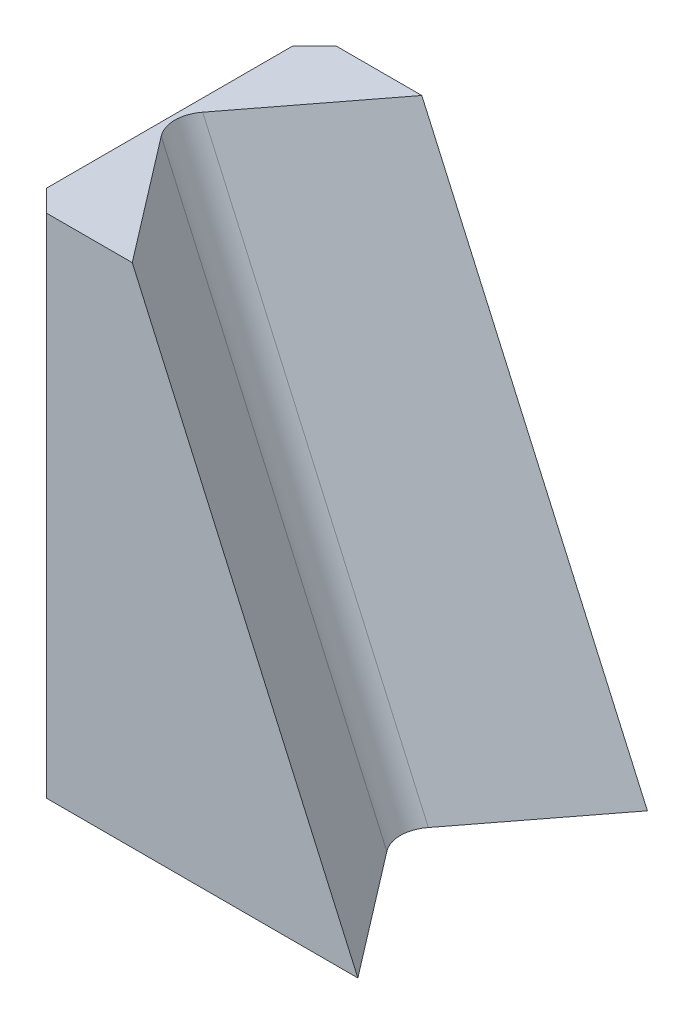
from build123d import *

# Parameters (mm, degrees)
EXTRUDE_1_DEPTH                 = 4
CUT_EXTRUDE_1_REACH             = 11.611
CUT_EXTRUDE_1_DIRECTION_2_REACH = 11.611
CHAMFER_1_SIZE                  = 0.3


with BuildPart() as part:
    # Sketch 1 → Extrude 1 (new body)
    with BuildSketch(Plane.XY):
        Polygon((0, 7), (0, 0), (4.6, 0), (1.483399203, 7), align=None)
    extrude(amount=EXTRUDE_1_DEPTH)

    # Sketch 2 → Cut-Extrude 1 (cut, up to next)
    with BuildSketch(Plane(origin=(-2.355601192, 5.290766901, 0), x_dir=(0, 0, -1), z_dir=(0.40673664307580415, -0.9135454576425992, 0)), mode=Mode.PRIVATE) as cut_extrude_1_sk1:
        with BuildLine():
            Line((-4, 4.202309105), (-2.286788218, 3.002705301))
            ThreePointArc((-2.286788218, 3.002705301), (-2, 2.912281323), (-1.713211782, 3.002705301))
            Line((-1.713211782, 3.002705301), (0, 4.202309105))
            Line((0, 4.202309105), (-4, 4.202309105))
        make_face()
    cut_extrude_1_tool1 = extrude(cut_extrude_1_sk1.sketch, amount=-CUT_EXTRUDE_1_REACH, mode=Mode.PRIVATE) & part.part
    add(cut_extrude_1_tool1.solids().sort_by_distance((1.063178, 6.812905, 2))[0], mode=Mode.SUBTRACT)

    # Sketch 2 → Cut-Extrude 1 direction 2 (cut, up to next)
    with BuildSketch(Plane(origin=(-2.355601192, 5.290766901, 0), x_dir=(0, 0, -1), z_dir=(0.40673664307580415, -0.9135454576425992, 0)), mode=Mode.PRIVATE) as cut_extrude_1_direction_2_sk1:
        with BuildLine():
            Line((-4, 4.202309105), (-2.286788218, 3.002705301))
            ThreePointArc((-2.286788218, 3.002705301), (-2, 2.912281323), (-1.713211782, 3.002705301))
            Line((-1.713211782, 3.002705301), (0, 4.202309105))
            Line((0, 4.202309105), (-4, 4.202309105))
        make_face()
    cut_extrude_1_direction_2_tool1 = extrude(cut_extrude_1_direction_2_sk1.sketch, amount=CUT_EXTRUDE_1_DIRECTION_2_REACH, mode=Mode.PRIVATE) & part.part
    add(cut_extrude_1_direction_2_tool1.solids().sort_by_distance((1.063178, 6.812905, 2))[0], mode=Mode.SUBTRACT)

    # Chamfer 1
    chamfer_1_edges = [part.edges().sort_by_distance(p)[0] for p in [
        (0, 3.5, 0),
        (0, 3.5, 4),
    ]]
    chamfer(chamfer_1_edges, length=CHAMFER_1_SIZE)


solid = part.part
